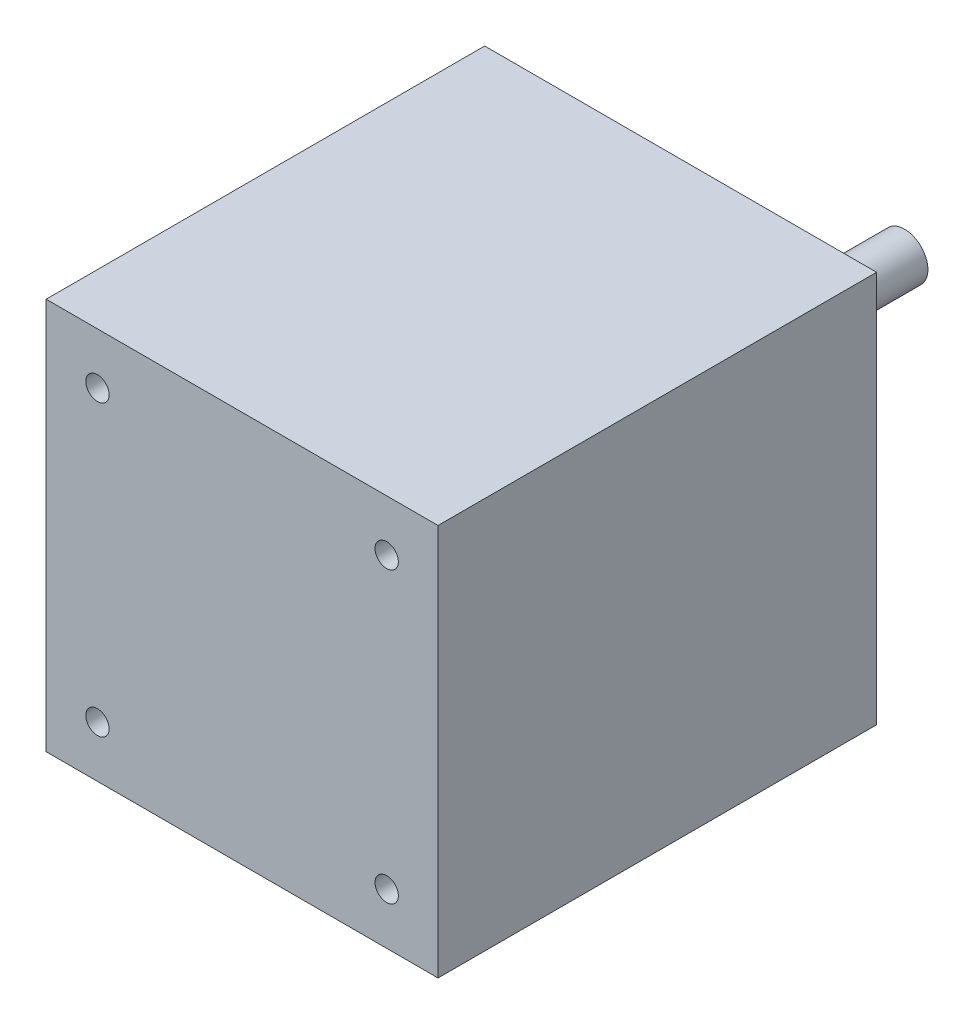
ISO-10303-21;
HEADER;
FILE_DESCRIPTION(('STEP AP214'),'2;1');
FILE_NAME('part.step','',(''),(''),'','','');
FILE_SCHEMA(('AUTOMOTIVE_DESIGN { 1 0 10303 214 1 1 1 1 }'));
ENDSEC;
DATA;
#1=APPLICATION_CONTEXT('core data for automotive mechanical design processes');
#2=APPLICATION_PROTOCOL_DEFINITION('international standard','automotive_design',2000,#1);
#3=PRODUCT_CONTEXT('',#1,'mechanical');
#4=PRODUCT('Part','Part','',(#3));
#5=PRODUCT_RELATED_PRODUCT_CATEGORY('part','',(#4));
#6=PRODUCT_DEFINITION_FORMATION('','',#4);
#7=PRODUCT_DEFINITION_CONTEXT('part definition',#1,'design');
#8=PRODUCT_DEFINITION('design','',#6,#7);
#9=PRODUCT_DEFINITION_SHAPE('','',#8);
#10=(LENGTH_UNIT() NAMED_UNIT(*) SI_UNIT(.MILLI.,.METRE.));
#11=(NAMED_UNIT(*) PLANE_ANGLE_UNIT() SI_UNIT($,.RADIAN.));
#12=(NAMED_UNIT(*) SI_UNIT($,.STERADIAN.) SOLID_ANGLE_UNIT());
#13=UNCERTAINTY_MEASURE_WITH_UNIT(LENGTH_MEASURE(1.E-05),#10,'distance_accuracy_value','');
#14=(GEOMETRIC_REPRESENTATION_CONTEXT(3) GLOBAL_UNCERTAINTY_ASSIGNED_CONTEXT((#13)) GLOBAL_UNIT_ASSIGNED_CONTEXT((#10,
#11,#12)) REPRESENTATION_CONTEXT('',''));
#15=CARTESIAN_POINT('',(0.,0.,0.));
#16=DIRECTION('',(0.,0.,1.));
#17=DIRECTION('',(1.,0.,0.));
#18=AXIS2_PLACEMENT_3D('',#15,#16,#17);
#19=CARTESIAN_POINT('',(0.,0.,47.));
#20=DIRECTION('',(0.,0.,1.));
#21=DIRECTION('',(1.,0.,0.));
#22=AXIS2_PLACEMENT_3D('',#19,#20,#21);
#23=PLANE('',#22);
#24=CARTESIAN_POINT('',(15.5000000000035,-15.4999999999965,47.));
#25=DIRECTION('',(0.,0.,1.));
#26=DIRECTION('',(1.,0.,0.));
#27=AXIS2_PLACEMENT_3D('',#24,#25,#26);
#28=CIRCLE('',#27,1.25);
#29=CARTESIAN_POINT('',(16.7500000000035,-15.4999999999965,47.));
#30=VERTEX_POINT('',#29);
#31=EDGE_CURVE('E141',#30,#30,#28,.T.);
#32=ORIENTED_EDGE('',*,*,#31,.F.);
#33=EDGE_LOOP('',(#32));
#34=FACE_BOUND('',#33,.T.);
#35=CARTESIAN_POINT('',(-15.4999999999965,15.4999999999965,47.));
#36=DIRECTION('',(0.,0.,1.));
#37=DIRECTION('',(1.,0.,0.));
#38=AXIS2_PLACEMENT_3D('',#35,#36,#37);
#39=CIRCLE('',#38,1.25);
#40=CARTESIAN_POINT('',(-14.2499999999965,15.4999999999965,47.));
#41=VERTEX_POINT('',#40);
#42=EDGE_CURVE('E103',#41,#41,#39,.T.);
#43=ORIENTED_EDGE('',*,*,#42,.F.);
#44=EDGE_LOOP('',(#43));
#45=FACE_BOUND('',#44,.T.);
#46=DIRECTION('',(0.,1.,0.));
#47=VECTOR('',#46,1.);
#48=CARTESIAN_POINT('',(21.,21.,47.));
#49=LINE('',#48,#47);
#50=CARTESIAN_POINT('',(21.,-21.,47.));
#51=VERTEX_POINT('',#50);
#52=CARTESIAN_POINT('',(21.,21.,47.));
#53=VERTEX_POINT('',#52);
#54=EDGE_CURVE('E86',#51,#53,#49,.T.);
#55=ORIENTED_EDGE('',*,*,#54,.T.);
#56=DIRECTION('',(-1.,0.,0.));
#57=VECTOR('',#56,1.);
#58=CARTESIAN_POINT('',(-21.,21.,47.));
#59=LINE('',#58,#57);
#60=CARTESIAN_POINT('',(-21.,21.,47.));
#61=VERTEX_POINT('',#60);
#62=EDGE_CURVE('E81',#53,#61,#59,.T.);
#63=ORIENTED_EDGE('',*,*,#62,.T.);
#64=DIRECTION('',(0.,-1.,0.));
#65=VECTOR('',#64,1.);
#66=CARTESIAN_POINT('',(-21.,21.,47.));
#67=LINE('',#66,#65);
#68=CARTESIAN_POINT('',(-21.,-21.,47.));
#69=VERTEX_POINT('',#68);
#70=EDGE_CURVE('E84',#61,#69,#67,.T.);
#71=ORIENTED_EDGE('',*,*,#70,.T.);
#72=DIRECTION('',(1.,0.,0.));
#73=VECTOR('',#72,1.);
#74=CARTESIAN_POINT('',(-21.,-21.,47.));
#75=LINE('',#74,#73);
#76=EDGE_CURVE('E50',#69,#51,#75,.T.);
#77=ORIENTED_EDGE('',*,*,#76,.T.);
#78=EDGE_LOOP('',(#55,#63,#71,#77));
#79=FACE_BOUND('',#78,.T.);
#80=CARTESIAN_POINT('',(15.5000000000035,15.4999999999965,47.));
#81=DIRECTION('',(0.,0.,1.));
#82=DIRECTION('',(-1.,0.,0.));
#83=AXIS2_PLACEMENT_3D('',#80,#81,#82);
#84=CIRCLE('',#83,1.25);
#85=CARTESIAN_POINT('',(14.2500000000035,15.4999999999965,47.));
#86=VERTEX_POINT('',#85);
#87=EDGE_CURVE('E145',#86,#86,#84,.T.);
#88=ORIENTED_EDGE('',*,*,#87,.F.);
#89=EDGE_LOOP('',(#88));
#90=FACE_BOUND('',#89,.T.);
#91=CARTESIAN_POINT('',(-15.4999999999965,-15.4999999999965,47.));
#92=DIRECTION('',(0.,0.,1.));
#93=DIRECTION('',(-1.,0.,0.));
#94=AXIS2_PLACEMENT_3D('',#91,#92,#93);
#95=CIRCLE('',#94,1.25);
#96=CARTESIAN_POINT('',(-16.7499999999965,-15.4999999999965,47.));
#97=VERTEX_POINT('',#96);
#98=EDGE_CURVE('E132',#97,#97,#95,.T.);
#99=ORIENTED_EDGE('',*,*,#98,.F.);
#100=EDGE_LOOP('',(#99));
#101=FACE_BOUND('',#100,.T.);
#102=ADVANCED_FACE('F33',(#34,#45,#79,#90,#101),#23,.T.);
#103=CARTESIAN_POINT('',(0.,0.,0.));
#104=DIRECTION('',(0.,0.,1.));
#105=DIRECTION('',(1.,0.,0.));
#106=AXIS2_PLACEMENT_3D('',#103,#104,#105);
#107=PLANE('',#106);
#108=CARTESIAN_POINT('',(0.,0.,0.));
#109=DIRECTION('',(0.,0.,1.));
#110=DIRECTION('',(1.,0.,0.));
#111=AXIS2_PLACEMENT_3D('',#108,#109,#110);
#112=CIRCLE('',#111,11.);
#113=CARTESIAN_POINT('',(11.,0.,0.));
#114=VERTEX_POINT('',#113);
#115=EDGE_CURVE('E11',#114,#114,#112,.F.);
#116=ORIENTED_EDGE('',*,*,#115,.F.);
#117=EDGE_LOOP('',(#116));
#118=FACE_BOUND('',#117,.T.);
#119=DIRECTION('',(0.,1.,0.));
#120=VECTOR('',#119,1.);
#121=CARTESIAN_POINT('',(21.,21.,0.));
#122=LINE('',#121,#120);
#123=CARTESIAN_POINT('',(21.,-21.,0.));
#124=VERTEX_POINT('',#123);
#125=CARTESIAN_POINT('',(21.,21.,0.));
#126=VERTEX_POINT('',#125);
#127=EDGE_CURVE('E100',#124,#126,#122,.T.);
#128=ORIENTED_EDGE('',*,*,#127,.F.);
#129=DIRECTION('',(1.,0.,0.));
#130=VECTOR('',#129,1.);
#131=CARTESIAN_POINT('',(-21.,-21.,0.));
#132=LINE('',#131,#130);
#133=CARTESIAN_POINT('',(-21.,-21.,0.));
#134=VERTEX_POINT('',#133);
#135=EDGE_CURVE('E73',#134,#124,#132,.T.);
#136=ORIENTED_EDGE('',*,*,#135,.F.);
#137=DIRECTION('',(0.,-1.,0.));
#138=VECTOR('',#137,1.);
#139=CARTESIAN_POINT('',(-21.,21.,0.));
#140=LINE('',#139,#138);
#141=CARTESIAN_POINT('',(-21.,21.,0.));
#142=VERTEX_POINT('',#141);
#143=EDGE_CURVE('E67',#142,#134,#140,.T.);
#144=ORIENTED_EDGE('',*,*,#143,.F.);
#145=DIRECTION('',(-1.,0.,0.));
#146=VECTOR('',#145,1.);
#147=CARTESIAN_POINT('',(-21.,21.,0.));
#148=LINE('',#147,#146);
#149=EDGE_CURVE('E91',#126,#142,#148,.T.);
#150=ORIENTED_EDGE('',*,*,#149,.F.);
#151=EDGE_LOOP('',(#128,#136,#144,#150));
#152=FACE_BOUND('',#151,.T.);
#153=CARTESIAN_POINT('',(-15.4999999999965,15.4999999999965,0.));
#154=DIRECTION('',(0.,0.,1.));
#155=DIRECTION('',(1.,0.,0.));
#156=AXIS2_PLACEMENT_3D('',#153,#154,#155);
#157=CIRCLE('',#156,1.25);
#158=CARTESIAN_POINT('',(-14.2499999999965,15.4999999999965,0.));
#159=VERTEX_POINT('',#158);
#160=EDGE_CURVE('E119',#159,#159,#157,.T.);
#161=ORIENTED_EDGE('',*,*,#160,.T.);
#162=EDGE_LOOP('',(#161));
#163=FACE_BOUND('',#162,.T.);
#164=CARTESIAN_POINT('',(15.5000000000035,15.4999999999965,0.));
#165=DIRECTION('',(0.,0.,1.));
#166=DIRECTION('',(-1.,0.,0.));
#167=AXIS2_PLACEMENT_3D('',#164,#165,#166);
#168=CIRCLE('',#167,1.25);
#169=CARTESIAN_POINT('',(14.2500000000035,15.4999999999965,0.));
#170=VERTEX_POINT('',#169);
#171=EDGE_CURVE('E123',#170,#170,#168,.T.);
#172=ORIENTED_EDGE('',*,*,#171,.T.);
#173=EDGE_LOOP('',(#172));
#174=FACE_BOUND('',#173,.T.);
#175=CARTESIAN_POINT('',(15.5000000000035,-15.4999999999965,0.));
#176=DIRECTION('',(0.,0.,1.));
#177=DIRECTION('',(1.,0.,0.));
#178=AXIS2_PLACEMENT_3D('',#175,#176,#177);
#179=CIRCLE('',#178,1.25);
#180=CARTESIAN_POINT('',(16.7500000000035,-15.4999999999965,0.));
#181=VERTEX_POINT('',#180);
#182=EDGE_CURVE('E127',#181,#181,#179,.T.);
#183=ORIENTED_EDGE('',*,*,#182,.T.);
#184=EDGE_LOOP('',(#183));
#185=FACE_BOUND('',#184,.T.);
#186=CARTESIAN_POINT('',(-15.4999999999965,-15.4999999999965,0.));
#187=DIRECTION('',(0.,0.,1.));
#188=DIRECTION('',(-1.,0.,0.));
#189=AXIS2_PLACEMENT_3D('',#186,#187,#188);
#190=CIRCLE('',#189,1.25);
#191=CARTESIAN_POINT('',(-16.7499999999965,-15.4999999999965,0.));
#192=VERTEX_POINT('',#191);
#193=EDGE_CURVE('E130',#192,#192,#190,.T.);
#194=ORIENTED_EDGE('',*,*,#193,.T.);
#195=EDGE_LOOP('',(#194));
#196=FACE_BOUND('',#195,.T.);
#197=ADVANCED_FACE('F111',(#118,#152,#163,#174,#185,#196),#107,.F.);
#198=CARTESIAN_POINT('',(21.,21.,47.));
#199=DIRECTION('',(-1.,0.,0.));
#200=DIRECTION('',(0.,-1.,0.));
#201=AXIS2_PLACEMENT_3D('',#198,#199,#200);
#202=PLANE('',#201);
#203=ORIENTED_EDGE('',*,*,#127,.T.);
#204=DIRECTION('',(0.,0.,-1.));
#205=VECTOR('',#204,1.);
#206=CARTESIAN_POINT('',(21.,21.,47.));
#207=LINE('',#206,#205);
#208=EDGE_CURVE('E42',#53,#126,#207,.T.);
#209=ORIENTED_EDGE('',*,*,#208,.F.);
#210=ORIENTED_EDGE('',*,*,#54,.F.);
#211=DIRECTION('',(0.,0.,-1.));
#212=VECTOR('',#211,1.);
#213=CARTESIAN_POINT('',(21.,-21.,47.));
#214=LINE('',#213,#212);
#215=EDGE_CURVE('E96',#51,#124,#214,.T.);
#216=ORIENTED_EDGE('',*,*,#215,.T.);
#217=EDGE_LOOP('',(#203,#209,#210,#216));
#218=FACE_BOUND('',#217,.T.);
#219=ADVANCED_FACE('F35',(#218),#202,.F.);
#220=CARTESIAN_POINT('',(-21.,21.,47.));
#221=DIRECTION('',(0.,-1.,0.));
#222=DIRECTION('',(0.,0.,-1.));
#223=AXIS2_PLACEMENT_3D('',#220,#221,#222);
#224=PLANE('',#223);
#225=ORIENTED_EDGE('',*,*,#149,.T.);
#226=DIRECTION('',(0.,0.,-1.));
#227=VECTOR('',#226,1.);
#228=CARTESIAN_POINT('',(-21.,21.,47.));
#229=LINE('',#228,#227);
#230=EDGE_CURVE('E89',#61,#142,#229,.T.);
#231=ORIENTED_EDGE('',*,*,#230,.F.);
#232=ORIENTED_EDGE('',*,*,#62,.F.);
#233=ORIENTED_EDGE('',*,*,#208,.T.);
#234=EDGE_LOOP('',(#225,#231,#232,#233));
#235=FACE_BOUND('',#234,.T.);
#236=ADVANCED_FACE('F90',(#235),#224,.F.);
#237=CARTESIAN_POINT('',(-21.,21.,47.));
#238=DIRECTION('',(1.,0.,0.));
#239=DIRECTION('',(0.,1.,0.));
#240=AXIS2_PLACEMENT_3D('',#237,#238,#239);
#241=PLANE('',#240);
#242=ORIENTED_EDGE('',*,*,#143,.T.);
#243=DIRECTION('',(0.,0.,-1.));
#244=VECTOR('',#243,1.);
#245=CARTESIAN_POINT('',(-21.,-21.,47.));
#246=LINE('',#245,#244);
#247=EDGE_CURVE('E92',#69,#134,#246,.T.);
#248=ORIENTED_EDGE('',*,*,#247,.F.);
#249=ORIENTED_EDGE('',*,*,#70,.F.);
#250=ORIENTED_EDGE('',*,*,#230,.T.);
#251=EDGE_LOOP('',(#242,#248,#249,#250));
#252=FACE_BOUND('',#251,.T.);
#253=ADVANCED_FACE('F94',(#252),#241,.F.);
#254=CARTESIAN_POINT('',(-21.,-21.,47.));
#255=DIRECTION('',(0.,1.,0.));
#256=DIRECTION('',(0.,0.,1.));
#257=AXIS2_PLACEMENT_3D('',#254,#255,#256);
#258=PLANE('',#257);
#259=ORIENTED_EDGE('',*,*,#135,.T.);
#260=ORIENTED_EDGE('',*,*,#215,.F.);
#261=ORIENTED_EDGE('',*,*,#76,.F.);
#262=ORIENTED_EDGE('',*,*,#247,.T.);
#263=EDGE_LOOP('',(#259,#260,#261,#262));
#264=FACE_BOUND('',#263,.T.);
#265=ADVANCED_FACE('F165',(#264),#258,.F.);
#266=CARTESIAN_POINT('',(-15.4999999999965,15.4999999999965,47.));
#267=DIRECTION('',(0.,0.,-1.));
#268=DIRECTION('',(-1.,0.,0.));
#269=AXIS2_PLACEMENT_3D('',#266,#267,#268);
#270=CYLINDRICAL_SURFACE('',#269,1.25);
#271=ORIENTED_EDGE('',*,*,#42,.T.);
#272=EDGE_LOOP('',(#271));
#273=FACE_BOUND('',#272,.T.);
#274=ORIENTED_EDGE('',*,*,#160,.F.);
#275=EDGE_LOOP('',(#274));
#276=FACE_BOUND('',#275,.T.);
#277=ADVANCED_FACE('F153',(#273,#276),#270,.F.);
#278=CARTESIAN_POINT('',(15.5000000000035,15.4999999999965,47.));
#279=DIRECTION('',(0.,0.,-1.));
#280=DIRECTION('',(-1.,0.,0.));
#281=AXIS2_PLACEMENT_3D('',#278,#279,#280);
#282=CYLINDRICAL_SURFACE('',#281,1.25);
#283=ORIENTED_EDGE('',*,*,#87,.T.);
#284=EDGE_LOOP('',(#283));
#285=FACE_BOUND('',#284,.T.);
#286=ORIENTED_EDGE('',*,*,#171,.F.);
#287=EDGE_LOOP('',(#286));
#288=FACE_BOUND('',#287,.T.);
#289=ADVANCED_FACE('F236',(#285,#288),#282,.F.);
#290=CARTESIAN_POINT('',(15.5000000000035,-15.4999999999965,47.));
#291=DIRECTION('',(0.,0.,-1.));
#292=DIRECTION('',(-1.,0.,0.));
#293=AXIS2_PLACEMENT_3D('',#290,#291,#292);
#294=CYLINDRICAL_SURFACE('',#293,1.25);
#295=ORIENTED_EDGE('',*,*,#31,.T.);
#296=EDGE_LOOP('',(#295));
#297=FACE_BOUND('',#296,.T.);
#298=ORIENTED_EDGE('',*,*,#182,.F.);
#299=EDGE_LOOP('',(#298));
#300=FACE_BOUND('',#299,.T.);
#301=ADVANCED_FACE('F233',(#297,#300),#294,.F.);
#302=CARTESIAN_POINT('',(-15.4999999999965,-15.4999999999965,47.));
#303=DIRECTION('',(0.,0.,-1.));
#304=DIRECTION('',(-1.,0.,0.));
#305=AXIS2_PLACEMENT_3D('',#302,#303,#304);
#306=CYLINDRICAL_SURFACE('',#305,1.25);
#307=ORIENTED_EDGE('',*,*,#98,.T.);
#308=EDGE_LOOP('',(#307));
#309=FACE_BOUND('',#308,.T.);
#310=ORIENTED_EDGE('',*,*,#193,.F.);
#311=EDGE_LOOP('',(#310));
#312=FACE_BOUND('',#311,.T.);
#313=ADVANCED_FACE('F186',(#309,#312),#306,.F.);
#314=CARTESIAN_POINT('',(0.,0.,-2.));
#315=DIRECTION('',(0.,0.,1.));
#316=DIRECTION('',(1.,0.,0.));
#317=AXIS2_PLACEMENT_3D('',#314,#315,#316);
#318=CYLINDRICAL_SURFACE('',#317,11.);
#319=CARTESIAN_POINT('',(0.,0.,-2.));
#320=DIRECTION('',(0.,0.,-1.));
#321=DIRECTION('',(-1.,0.,0.));
#322=AXIS2_PLACEMENT_3D('',#319,#320,#321);
#323=CIRCLE('',#322,11.);
#324=CARTESIAN_POINT('',(-11.,0.,-2.));
#325=VERTEX_POINT('',#324);
#326=EDGE_CURVE('E133',#325,#325,#323,.T.);
#327=ORIENTED_EDGE('',*,*,#326,.F.);
#328=EDGE_LOOP('',(#327));
#329=FACE_BOUND('',#328,.T.);
#330=ORIENTED_EDGE('',*,*,#115,.T.);
#331=EDGE_LOOP('',(#330));
#332=FACE_BOUND('',#331,.T.);
#333=ADVANCED_FACE('F191',(#329,#332),#318,.T.);
#334=CARTESIAN_POINT('',(0.,0.,-2.));
#335=DIRECTION('',(0.,0.,-1.));
#336=DIRECTION('',(-1.,0.,0.));
#337=AXIS2_PLACEMENT_3D('',#334,#335,#336);
#338=PLANE('',#337);
#339=CARTESIAN_POINT('',(0.,0.,-2.));
#340=DIRECTION('',(0.,0.,-1.));
#341=DIRECTION('',(-1.,0.,0.));
#342=AXIS2_PLACEMENT_3D('',#339,#340,#341);
#343=CIRCLE('',#342,2.5);
#344=CARTESIAN_POINT('',(-2.5,0.,-2.));
#345=VERTEX_POINT('',#344);
#346=EDGE_CURVE('E285',#345,#345,#343,.T.);
#347=ORIENTED_EDGE('',*,*,#346,.F.);
#348=EDGE_LOOP('',(#347));
#349=FACE_BOUND('',#348,.T.);
#350=ORIENTED_EDGE('',*,*,#326,.T.);
#351=EDGE_LOOP('',(#350));
#352=FACE_BOUND('',#351,.T.);
#353=ADVANCED_FACE('F196',(#349,#352),#338,.T.);
#354=CARTESIAN_POINT('',(0.,0.,-24.));
#355=DIRECTION('',(0.,0.,1.));
#356=DIRECTION('',(1.,0.,0.));
#357=AXIS2_PLACEMENT_3D('',#354,#355,#356);
#358=CYLINDRICAL_SURFACE('',#357,2.5);
#359=CARTESIAN_POINT('',(0.,0.,-24.));
#360=DIRECTION('',(0.,0.,-1.));
#361=DIRECTION('',(-1.,0.,0.));
#362=AXIS2_PLACEMENT_3D('',#359,#360,#361);
#363=CIRCLE('',#362,2.5);
#364=CARTESIAN_POINT('',(-2.5,0.,-24.));
#365=VERTEX_POINT('',#364);
#366=EDGE_CURVE('E138',#365,#365,#363,.T.);
#367=ORIENTED_EDGE('',*,*,#366,.F.);
#368=EDGE_LOOP('',(#367));
#369=FACE_BOUND('',#368,.T.);
#370=ORIENTED_EDGE('',*,*,#346,.T.);
#371=EDGE_LOOP('',(#370));
#372=FACE_BOUND('',#371,.T.);
#373=ADVANCED_FACE('F206',(#369,#372),#358,.T.);
#374=CARTESIAN_POINT('',(0.,0.,-24.));
#375=DIRECTION('',(0.,0.,-1.));
#376=DIRECTION('',(-1.,0.,0.));
#377=AXIS2_PLACEMENT_3D('',#374,#375,#376);
#378=PLANE('',#377);
#379=ORIENTED_EDGE('',*,*,#366,.T.);
#380=EDGE_LOOP('',(#379));
#381=FACE_BOUND('',#380,.T.);
#382=ADVANCED_FACE('F216',(#381),#378,.T.);
#383=CLOSED_SHELL('',(#102,#197,#219,#236,#253,#265,#277,#289,#301,#313,#333,#353,#373,#382));
#384=MANIFOLD_SOLID_BREP('B2',#383);
#385=ADVANCED_BREP_SHAPE_REPRESENTATION('',(#18,#384),#14);
#386=SHAPE_DEFINITION_REPRESENTATION(#9,#385);
ENDSEC;
END-ISO-10303-21;
